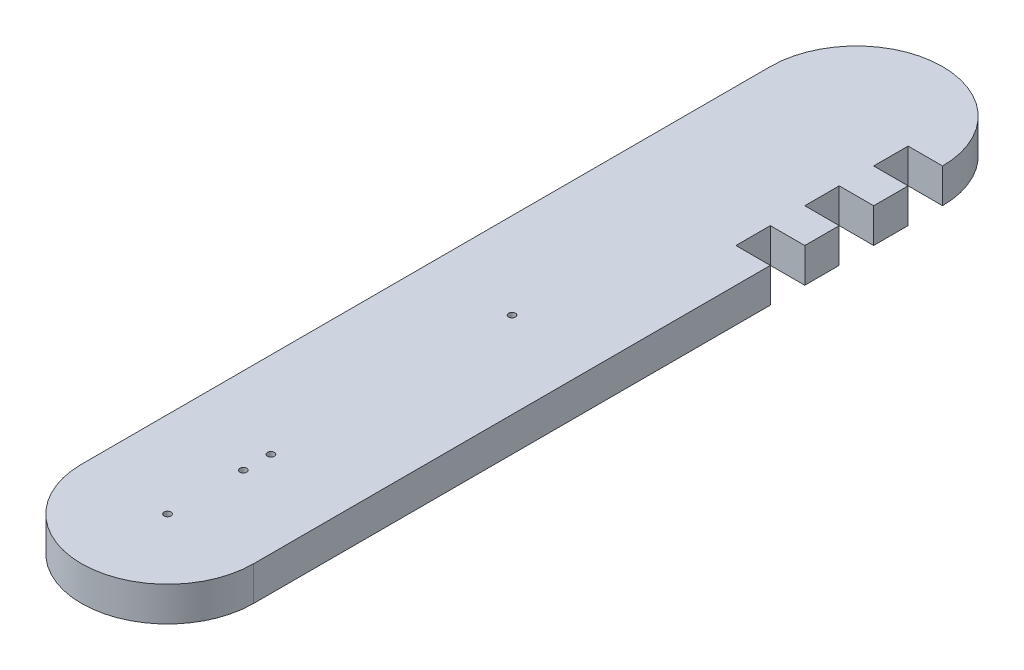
ISO-10303-21;
HEADER;
FILE_DESCRIPTION(('STEP AP214'),'2;1');
FILE_NAME('part.step','',(''),(''),'','','');
FILE_SCHEMA(('AUTOMOTIVE_DESIGN { 1 0 10303 214 1 1 1 1 }'));
ENDSEC;
DATA;
#1=APPLICATION_CONTEXT('core data for automotive mechanical design processes');
#2=APPLICATION_PROTOCOL_DEFINITION('international standard','automotive_design',2000,#1);
#3=PRODUCT_CONTEXT('',#1,'mechanical');
#4=PRODUCT('Part','Part','',(#3));
#5=PRODUCT_RELATED_PRODUCT_CATEGORY('part','',(#4));
#6=PRODUCT_DEFINITION_FORMATION('','',#4);
#7=PRODUCT_DEFINITION_CONTEXT('part definition',#1,'design');
#8=PRODUCT_DEFINITION('design','',#6,#7);
#9=PRODUCT_DEFINITION_SHAPE('','',#8);
#10=(LENGTH_UNIT() NAMED_UNIT(*) SI_UNIT(.MILLI.,.METRE.));
#11=(NAMED_UNIT(*) PLANE_ANGLE_UNIT() SI_UNIT($,.RADIAN.));
#12=(NAMED_UNIT(*) SI_UNIT($,.STERADIAN.) SOLID_ANGLE_UNIT());
#13=UNCERTAINTY_MEASURE_WITH_UNIT(LENGTH_MEASURE(1.E-05),#10,'distance_accuracy_value','');
#14=(GEOMETRIC_REPRESENTATION_CONTEXT(3) GLOBAL_UNCERTAINTY_ASSIGNED_CONTEXT((#13)) GLOBAL_UNIT_ASSIGNED_CONTEXT((#10,
#11,#12)) REPRESENTATION_CONTEXT('',''));
#15=CARTESIAN_POINT('',(0.,0.,0.));
#16=DIRECTION('',(0.,0.,1.));
#17=DIRECTION('',(1.,0.,0.));
#18=AXIS2_PLACEMENT_3D('',#15,#16,#17);
#19=CARTESIAN_POINT('',(25.,5.,100.));
#20=DIRECTION('',(-1.,0.,0.));
#21=DIRECTION('',(0.,0.,1.));
#22=AXIS2_PLACEMENT_3D('',#19,#20,#21);
#23=PLANE('',#22);
#24=DIRECTION('',(0.,0.,-1.));
#25=VECTOR('',#24,1.);
#26=CARTESIAN_POINT('',(25.,0.,100.));
#27=LINE('',#26,#25);
#28=CARTESIAN_POINT('',(25.,0.,20.));
#29=VERTEX_POINT('',#28);
#30=CARTESIAN_POINT('',(25.,0.,15.));
#31=VERTEX_POINT('',#30);
#32=EDGE_CURVE('E270',#29,#31,#27,.T.);
#33=ORIENTED_EDGE('',*,*,#32,.T.);
#34=DIRECTION('',(0.,1.,0.));
#35=VECTOR('',#34,1.);
#36=CARTESIAN_POINT('',(25.,0.,15.));
#37=LINE('',#36,#35);
#38=CARTESIAN_POINT('',(25.,5.,15.));
#39=VERTEX_POINT('',#38);
#40=EDGE_CURVE('E185',#31,#39,#37,.T.);
#41=ORIENTED_EDGE('',*,*,#40,.T.);
#42=DIRECTION('',(0.,0.,-1.));
#43=VECTOR('',#42,1.);
#44=CARTESIAN_POINT('',(25.,5.,100.));
#45=LINE('',#44,#43);
#46=CARTESIAN_POINT('',(25.,5.,20.));
#47=VERTEX_POINT('',#46);
#48=EDGE_CURVE('E261',#47,#39,#45,.T.);
#49=ORIENTED_EDGE('',*,*,#48,.F.);
#50=DIRECTION('',(0.,1.,0.));
#51=VECTOR('',#50,1.);
#52=CARTESIAN_POINT('',(25.,0.,20.));
#53=LINE('',#52,#51);
#54=EDGE_CURVE('E202',#29,#47,#53,.T.);
#55=ORIENTED_EDGE('',*,*,#54,.F.);
#56=EDGE_LOOP('',(#33,#41,#49,#55));
#57=FACE_BOUND('',#56,.T.);
#58=ADVANCED_FACE('F32',(#57),#23,.F.);
#59=CARTESIAN_POINT('',(25.,0.,100.));
#60=VERTEX_POINT('',#59);
#61=CARTESIAN_POINT('',(25.,0.,25.));
#62=VERTEX_POINT('',#61);
#63=EDGE_CURVE('E252',#60,#62,#27,.T.);
#64=ORIENTED_EDGE('',*,*,#63,.T.);
#65=DIRECTION('',(0.,1.,0.));
#66=VECTOR('',#65,1.);
#67=CARTESIAN_POINT('',(25.,0.,25.));
#68=LINE('',#67,#66);
#69=CARTESIAN_POINT('',(25.,5.,25.));
#70=VERTEX_POINT('',#69);
#71=EDGE_CURVE('E209',#62,#70,#68,.T.);
#72=ORIENTED_EDGE('',*,*,#71,.T.);
#73=CARTESIAN_POINT('',(25.,5.,100.));
#74=VERTEX_POINT('',#73);
#75=EDGE_CURVE('E257',#74,#70,#45,.T.);
#76=ORIENTED_EDGE('',*,*,#75,.F.);
#77=DIRECTION('',(0.,-1.,0.));
#78=VECTOR('',#77,1.);
#79=CARTESIAN_POINT('',(25.,5.,100.));
#80=LINE('',#79,#78);
#81=EDGE_CURVE('E272',#74,#60,#80,.T.);
#82=ORIENTED_EDGE('',*,*,#81,.T.);
#83=EDGE_LOOP('',(#64,#72,#76,#82));
#84=FACE_BOUND('',#83,.T.);
#85=ADVANCED_FACE('F285',(#84),#23,.F.);
#86=CARTESIAN_POINT('',(12.5,5.,0.));
#87=DIRECTION('',(0.,1.,0.));
#88=DIRECTION('',(0.,0.,1.));
#89=AXIS2_PLACEMENT_3D('',#86,#87,#88);
#90=PLANE('',#89);
#91=DIRECTION('',(1.,0.,0.));
#92=VECTOR('',#91,1.);
#93=CARTESIAN_POINT('',(20.,5.,5.));
#94=LINE('',#93,#92);
#95=CARTESIAN_POINT('',(20.,5.,5.));
#96=VERTEX_POINT('',#95);
#97=CARTESIAN_POINT('',(25.,5.,5.));
#98=VERTEX_POINT('',#97);
#99=EDGE_CURVE('E164',#96,#98,#94,.T.);
#100=ORIENTED_EDGE('',*,*,#99,.F.);
#101=DIRECTION('',(0.,0.,1.));
#102=VECTOR('',#101,1.);
#103=CARTESIAN_POINT('',(20.,5.,0.));
#104=LINE('',#103,#102);
#105=CARTESIAN_POINT('',(20.,5.,0.));
#106=VERTEX_POINT('',#105);
#107=EDGE_CURVE('E166',#106,#96,#104,.T.);
#108=ORIENTED_EDGE('',*,*,#107,.F.);
#109=DIRECTION('',(-1.,0.,0.));
#110=VECTOR('',#109,1.);
#111=CARTESIAN_POINT('',(25.,5.,0.));
#112=LINE('',#111,#110);
#113=CARTESIAN_POINT('',(25.,5.,0.));
#114=VERTEX_POINT('',#113);
#115=EDGE_CURVE('E145',#114,#106,#112,.T.);
#116=ORIENTED_EDGE('',*,*,#115,.F.);
#117=CARTESIAN_POINT('',(12.5,5.,0.));
#118=DIRECTION('',(0.,1.,0.));
#119=DIRECTION('',(0.,0.,1.));
#120=AXIS2_PLACEMENT_3D('',#117,#118,#119);
#121=CIRCLE('',#120,12.5);
#122=CARTESIAN_POINT('',(0.,5.,0.));
#123=VERTEX_POINT('',#122);
#124=EDGE_CURVE('E248',#114,#123,#121,.T.);
#125=ORIENTED_EDGE('',*,*,#124,.T.);
#126=DIRECTION('',(0.,0.,1.));
#127=VECTOR('',#126,1.);
#128=CARTESIAN_POINT('',(0.,5.,0.));
#129=LINE('',#128,#127);
#130=CARTESIAN_POINT('',(0.,5.,100.));
#131=VERTEX_POINT('',#130);
#132=EDGE_CURVE('E251',#123,#131,#129,.T.);
#133=ORIENTED_EDGE('',*,*,#132,.T.);
#134=CARTESIAN_POINT('',(12.5,5.,100.));
#135=DIRECTION('',(0.,1.,0.));
#136=DIRECTION('',(0.,0.,1.));
#137=AXIS2_PLACEMENT_3D('',#134,#135,#136);
#138=CIRCLE('',#137,12.5);
#139=EDGE_CURVE('E254',#131,#74,#138,.T.);
#140=ORIENTED_EDGE('',*,*,#139,.T.);
#141=ORIENTED_EDGE('',*,*,#75,.T.);
#142=DIRECTION('',(1.,0.,0.));
#143=VECTOR('',#142,1.);
#144=CARTESIAN_POINT('',(20.,5.,25.));
#145=LINE('',#144,#143);
#146=CARTESIAN_POINT('',(20.,5.,25.));
#147=VERTEX_POINT('',#146);
#148=EDGE_CURVE('E212',#147,#70,#145,.T.);
#149=ORIENTED_EDGE('',*,*,#148,.F.);
#150=DIRECTION('',(0.,0.,1.));
#151=VECTOR('',#150,1.);
#152=CARTESIAN_POINT('',(20.,5.,20.));
#153=LINE('',#152,#151);
#154=CARTESIAN_POINT('',(20.,5.,20.));
#155=VERTEX_POINT('',#154);
#156=EDGE_CURVE('E214',#155,#147,#153,.T.);
#157=ORIENTED_EDGE('',*,*,#156,.F.);
#158=DIRECTION('',(-1.,0.,0.));
#159=VECTOR('',#158,1.);
#160=CARTESIAN_POINT('',(25.,5.,20.));
#161=LINE('',#160,#159);
#162=EDGE_CURVE('E188',#47,#155,#161,.T.);
#163=ORIENTED_EDGE('',*,*,#162,.F.);
#164=ORIENTED_EDGE('',*,*,#48,.T.);
#165=DIRECTION('',(1.,0.,0.));
#166=VECTOR('',#165,1.);
#167=CARTESIAN_POINT('',(20.,5.,15.));
#168=LINE('',#167,#166);
#169=CARTESIAN_POINT('',(20.,5.,15.));
#170=VERTEX_POINT('',#169);
#171=EDGE_CURVE('E189',#170,#39,#168,.T.);
#172=ORIENTED_EDGE('',*,*,#171,.F.);
#173=DIRECTION('',(0.,0.,1.));
#174=VECTOR('',#173,1.);
#175=CARTESIAN_POINT('',(20.,5.,10.));
#176=LINE('',#175,#174);
#177=CARTESIAN_POINT('',(20.,5.,10.));
#178=VERTEX_POINT('',#177);
#179=EDGE_CURVE('E191',#178,#170,#176,.T.);
#180=ORIENTED_EDGE('',*,*,#179,.F.);
#181=DIRECTION('',(-1.,0.,0.));
#182=VECTOR('',#181,1.);
#183=CARTESIAN_POINT('',(25.,5.,10.));
#184=LINE('',#183,#182);
#185=CARTESIAN_POINT('',(25.,5.,10.));
#186=VERTEX_POINT('',#185);
#187=EDGE_CURVE('E171',#186,#178,#184,.T.);
#188=ORIENTED_EDGE('',*,*,#187,.F.);
#189=EDGE_CURVE('E256',#186,#98,#45,.T.);
#190=ORIENTED_EDGE('',*,*,#189,.T.);
#191=EDGE_LOOP('',(#100,#108,#116,#125,#133,#140,#141,#149,#157,#163,#164,#172,#180,#188,#190));
#192=FACE_BOUND('',#191,.T.);
#193=CARTESIAN_POINT('',(12.5,5.,85.));
#194=DIRECTION('',(0.,1.,0.));
#195=DIRECTION('',(0.,0.,1.));
#196=AXIS2_PLACEMENT_3D('',#193,#194,#195);
#197=CIRCLE('',#196,0.500000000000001);
#198=CARTESIAN_POINT('',(12.5,5.,85.5));
#199=VERTEX_POINT('',#198);
#200=EDGE_CURVE('E231',#199,#199,#197,.T.);
#201=ORIENTED_EDGE('',*,*,#200,.F.);
#202=EDGE_LOOP('',(#201));
#203=FACE_BOUND('',#202,.T.);
#204=CARTESIAN_POINT('',(12.5,5.,100.));
#205=DIRECTION('',(0.,1.,0.));
#206=DIRECTION('',(0.,0.,1.));
#207=AXIS2_PLACEMENT_3D('',#204,#205,#206);
#208=CIRCLE('',#207,0.500000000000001);
#209=CARTESIAN_POINT('',(12.5,5.,100.5));
#210=VERTEX_POINT('',#209);
#211=EDGE_CURVE('E243',#210,#210,#208,.T.);
#212=ORIENTED_EDGE('',*,*,#211,.F.);
#213=EDGE_LOOP('',(#212));
#214=FACE_BOUND('',#213,.T.);
#215=CARTESIAN_POINT('',(12.5,5.,89.));
#216=DIRECTION('',(0.,1.,0.));
#217=DIRECTION('',(0.,0.,1.));
#218=AXIS2_PLACEMENT_3D('',#215,#216,#217);
#219=CIRCLE('',#218,0.500000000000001);
#220=CARTESIAN_POINT('',(12.5,5.,89.5));
#221=VERTEX_POINT('',#220);
#222=EDGE_CURVE('E237',#221,#221,#219,.T.);
#223=ORIENTED_EDGE('',*,*,#222,.F.);
#224=EDGE_LOOP('',(#223));
#225=FACE_BOUND('',#224,.T.);
#226=CARTESIAN_POINT('',(12.5,5.,50.));
#227=DIRECTION('',(0.,1.,0.));
#228=DIRECTION('',(0.,0.,1.));
#229=AXIS2_PLACEMENT_3D('',#226,#227,#228);
#230=CIRCLE('',#229,0.500000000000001);
#231=CARTESIAN_POINT('',(12.5,5.,50.5));
#232=VERTEX_POINT('',#231);
#233=EDGE_CURVE('E225',#232,#232,#230,.T.);
#234=ORIENTED_EDGE('',*,*,#233,.F.);
#235=EDGE_LOOP('',(#234));
#236=FACE_BOUND('',#235,.T.);
#237=ADVANCED_FACE('F290',(#192,#203,#214,#225,#236),#90,.T.);
#238=CARTESIAN_POINT('',(12.5,0.,0.));
#239=DIRECTION('',(0.,1.,0.));
#240=DIRECTION('',(0.,0.,1.));
#241=AXIS2_PLACEMENT_3D('',#238,#239,#240);
#242=PLANE('',#241);
#243=DIRECTION('',(0.,0.,1.));
#244=VECTOR('',#243,1.);
#245=CARTESIAN_POINT('',(20.,0.,0.));
#246=LINE('',#245,#244);
#247=CARTESIAN_POINT('',(20.,0.,0.));
#248=VERTEX_POINT('',#247);
#249=CARTESIAN_POINT('',(20.,0.,5.));
#250=VERTEX_POINT('',#249);
#251=EDGE_CURVE('E153',#248,#250,#246,.T.);
#252=ORIENTED_EDGE('',*,*,#251,.T.);
#253=DIRECTION('',(1.,0.,0.));
#254=VECTOR('',#253,1.);
#255=CARTESIAN_POINT('',(20.,0.,5.));
#256=LINE('',#255,#254);
#257=CARTESIAN_POINT('',(25.,0.,5.));
#258=VERTEX_POINT('',#257);
#259=EDGE_CURVE('E150',#250,#258,#256,.T.);
#260=ORIENTED_EDGE('',*,*,#259,.T.);
#261=CARTESIAN_POINT('',(25.,0.,10.));
#262=VERTEX_POINT('',#261);
#263=EDGE_CURVE('E267',#262,#258,#27,.T.);
#264=ORIENTED_EDGE('',*,*,#263,.F.);
#265=DIRECTION('',(-1.,0.,0.));
#266=VECTOR('',#265,1.);
#267=CARTESIAN_POINT('',(25.,0.,10.));
#268=LINE('',#267,#266);
#269=CARTESIAN_POINT('',(20.,0.,10.));
#270=VERTEX_POINT('',#269);
#271=EDGE_CURVE('E47',#262,#270,#268,.T.);
#272=ORIENTED_EDGE('',*,*,#271,.T.);
#273=DIRECTION('',(0.,0.,1.));
#274=VECTOR('',#273,1.);
#275=CARTESIAN_POINT('',(20.,0.,10.));
#276=LINE('',#275,#274);
#277=CARTESIAN_POINT('',(20.,0.,15.));
#278=VERTEX_POINT('',#277);
#279=EDGE_CURVE('E198',#270,#278,#276,.T.);
#280=ORIENTED_EDGE('',*,*,#279,.T.);
#281=DIRECTION('',(1.,0.,0.));
#282=VECTOR('',#281,1.);
#283=CARTESIAN_POINT('',(20.,0.,15.));
#284=LINE('',#283,#282);
#285=EDGE_CURVE('E180',#278,#31,#284,.T.);
#286=ORIENTED_EDGE('',*,*,#285,.T.);
#287=ORIENTED_EDGE('',*,*,#32,.F.);
#288=DIRECTION('',(-1.,0.,0.));
#289=VECTOR('',#288,1.);
#290=CARTESIAN_POINT('',(25.,0.,20.));
#291=LINE('',#290,#289);
#292=CARTESIAN_POINT('',(20.,0.,20.));
#293=VERTEX_POINT('',#292);
#294=EDGE_CURVE('E55',#29,#293,#291,.T.);
#295=ORIENTED_EDGE('',*,*,#294,.T.);
#296=DIRECTION('',(0.,0.,1.));
#297=VECTOR('',#296,1.);
#298=CARTESIAN_POINT('',(20.,0.,20.));
#299=LINE('',#298,#297);
#300=CARTESIAN_POINT('',(20.,0.,25.));
#301=VERTEX_POINT('',#300);
#302=EDGE_CURVE('E221',#293,#301,#299,.T.);
#303=ORIENTED_EDGE('',*,*,#302,.T.);
#304=DIRECTION('',(1.,0.,0.));
#305=VECTOR('',#304,1.);
#306=CARTESIAN_POINT('',(20.,0.,25.));
#307=LINE('',#306,#305);
#308=EDGE_CURVE('E204',#301,#62,#307,.T.);
#309=ORIENTED_EDGE('',*,*,#308,.T.);
#310=ORIENTED_EDGE('',*,*,#63,.F.);
#311=CARTESIAN_POINT('',(12.5,0.,100.));
#312=DIRECTION('',(0.,1.,0.));
#313=DIRECTION('',(0.,0.,1.));
#314=AXIS2_PLACEMENT_3D('',#311,#312,#313);
#315=CIRCLE('',#314,12.5);
#316=CARTESIAN_POINT('',(0.,0.,100.));
#317=VERTEX_POINT('',#316);
#318=EDGE_CURVE('E265',#317,#60,#315,.T.);
#319=ORIENTED_EDGE('',*,*,#318,.F.);
#320=DIRECTION('',(0.,0.,1.));
#321=VECTOR('',#320,1.);
#322=CARTESIAN_POINT('',(0.,0.,0.));
#323=LINE('',#322,#321);
#324=CARTESIAN_POINT('',(0.,0.,0.));
#325=VERTEX_POINT('',#324);
#326=EDGE_CURVE('E263',#325,#317,#323,.T.);
#327=ORIENTED_EDGE('',*,*,#326,.F.);
#328=CARTESIAN_POINT('',(12.5,0.,0.));
#329=DIRECTION('',(0.,1.,0.));
#330=DIRECTION('',(0.,0.,1.));
#331=AXIS2_PLACEMENT_3D('',#328,#329,#330);
#332=CIRCLE('',#331,12.5);
#333=CARTESIAN_POINT('',(25.,0.,0.));
#334=VERTEX_POINT('',#333);
#335=EDGE_CURVE('E163',#334,#325,#332,.T.);
#336=ORIENTED_EDGE('',*,*,#335,.F.);
#337=DIRECTION('',(-1.,0.,0.));
#338=VECTOR('',#337,1.);
#339=CARTESIAN_POINT('',(25.,0.,0.));
#340=LINE('',#339,#338);
#341=EDGE_CURVE('E142',#334,#248,#340,.T.);
#342=ORIENTED_EDGE('',*,*,#341,.T.);
#343=EDGE_LOOP('',(#252,#260,#264,#272,#280,#286,#287,#295,#303,#309,#310,#319,#327,#336,#342));
#344=FACE_BOUND('',#343,.T.);
#345=CARTESIAN_POINT('',(12.5,0.,100.));
#346=DIRECTION('',(0.,1.,0.));
#347=DIRECTION('',(0.,0.,1.));
#348=AXIS2_PLACEMENT_3D('',#345,#346,#347);
#349=CIRCLE('',#348,0.500000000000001);
#350=CARTESIAN_POINT('',(12.5,0.,100.5));
#351=VERTEX_POINT('',#350);
#352=EDGE_CURVE('E240',#351,#351,#349,.T.);
#353=ORIENTED_EDGE('',*,*,#352,.T.);
#354=EDGE_LOOP('',(#353));
#355=FACE_BOUND('',#354,.T.);
#356=CARTESIAN_POINT('',(12.5,0.,89.));
#357=DIRECTION('',(0.,1.,0.));
#358=DIRECTION('',(0.,0.,1.));
#359=AXIS2_PLACEMENT_3D('',#356,#357,#358);
#360=CIRCLE('',#359,0.500000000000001);
#361=CARTESIAN_POINT('',(12.5,0.,89.5));
#362=VERTEX_POINT('',#361);
#363=EDGE_CURVE('E234',#362,#362,#360,.T.);
#364=ORIENTED_EDGE('',*,*,#363,.T.);
#365=EDGE_LOOP('',(#364));
#366=FACE_BOUND('',#365,.T.);
#367=CARTESIAN_POINT('',(12.5,0.,85.));
#368=DIRECTION('',(0.,1.,0.));
#369=DIRECTION('',(0.,0.,1.));
#370=AXIS2_PLACEMENT_3D('',#367,#368,#369);
#371=CIRCLE('',#370,0.500000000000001);
#372=CARTESIAN_POINT('',(12.5,0.,85.5));
#373=VERTEX_POINT('',#372);
#374=EDGE_CURVE('E228',#373,#373,#371,.T.);
#375=ORIENTED_EDGE('',*,*,#374,.T.);
#376=EDGE_LOOP('',(#375));
#377=FACE_BOUND('',#376,.T.);
#378=CARTESIAN_POINT('',(12.5,0.,50.));
#379=DIRECTION('',(0.,1.,0.));
#380=DIRECTION('',(0.,0.,1.));
#381=AXIS2_PLACEMENT_3D('',#378,#379,#380);
#382=CIRCLE('',#381,0.500000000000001);
#383=CARTESIAN_POINT('',(12.5,0.,50.5));
#384=VERTEX_POINT('',#383);
#385=EDGE_CURVE('E176',#384,#384,#382,.T.);
#386=ORIENTED_EDGE('',*,*,#385,.T.);
#387=EDGE_LOOP('',(#386));
#388=FACE_BOUND('',#387,.T.);
#389=ADVANCED_FACE('F160',(#344,#355,#366,#377,#388),#242,.F.);
#390=CARTESIAN_POINT('',(12.5,5.,0.));
#391=DIRECTION('',(0.,-1.,0.));
#392=DIRECTION('',(0.,0.,-1.));
#393=AXIS2_PLACEMENT_3D('',#390,#391,#392);
#394=CYLINDRICAL_SURFACE('',#393,12.5);
#395=ORIENTED_EDGE('',*,*,#335,.T.);
#396=DIRECTION('',(0.,-1.,0.));
#397=VECTOR('',#396,1.);
#398=CARTESIAN_POINT('',(0.,5.,0.));
#399=LINE('',#398,#397);
#400=EDGE_CURVE('E11',#123,#325,#399,.T.);
#401=ORIENTED_EDGE('',*,*,#400,.F.);
#402=ORIENTED_EDGE('',*,*,#124,.F.);
#403=DIRECTION('',(0.,-1.,0.));
#404=VECTOR('',#403,1.);
#405=CARTESIAN_POINT('',(25.,5.,0.));
#406=LINE('',#405,#404);
#407=EDGE_CURVE('E260',#114,#334,#406,.T.);
#408=ORIENTED_EDGE('',*,*,#407,.T.);
#409=EDGE_LOOP('',(#395,#401,#402,#408));
#410=FACE_BOUND('',#409,.T.);
#411=ADVANCED_FACE('F34',(#410),#394,.T.);
#412=CARTESIAN_POINT('',(0.,5.,0.));
#413=DIRECTION('',(1.,0.,0.));
#414=DIRECTION('',(0.,0.,-1.));
#415=AXIS2_PLACEMENT_3D('',#412,#413,#414);
#416=PLANE('',#415);
#417=ORIENTED_EDGE('',*,*,#326,.T.);
#418=DIRECTION('',(0.,-1.,0.));
#419=VECTOR('',#418,1.);
#420=CARTESIAN_POINT('',(0.,5.,100.));
#421=LINE('',#420,#419);
#422=EDGE_CURVE('E40',#131,#317,#421,.T.);
#423=ORIENTED_EDGE('',*,*,#422,.F.);
#424=ORIENTED_EDGE('',*,*,#132,.F.);
#425=ORIENTED_EDGE('',*,*,#400,.T.);
#426=EDGE_LOOP('',(#417,#423,#424,#425));
#427=FACE_BOUND('',#426,.T.);
#428=ADVANCED_FACE('F295',(#427),#416,.F.);
#429=CARTESIAN_POINT('',(12.5,5.,100.));
#430=DIRECTION('',(0.,-1.,0.));
#431=DIRECTION('',(0.,0.,-1.));
#432=AXIS2_PLACEMENT_3D('',#429,#430,#431);
#433=CYLINDRICAL_SURFACE('',#432,12.5);
#434=ORIENTED_EDGE('',*,*,#318,.T.);
#435=ORIENTED_EDGE('',*,*,#81,.F.);
#436=ORIENTED_EDGE('',*,*,#139,.F.);
#437=ORIENTED_EDGE('',*,*,#422,.T.);
#438=EDGE_LOOP('',(#434,#435,#436,#437));
#439=FACE_BOUND('',#438,.T.);
#440=ADVANCED_FACE('F279',(#439),#433,.T.);
#441=ORIENTED_EDGE('',*,*,#263,.T.);
#442=DIRECTION('',(0.,1.,0.));
#443=VECTOR('',#442,1.);
#444=CARTESIAN_POINT('',(25.,0.,5.));
#445=LINE('',#444,#443);
#446=EDGE_CURVE('E173',#258,#98,#445,.T.);
#447=ORIENTED_EDGE('',*,*,#446,.T.);
#448=ORIENTED_EDGE('',*,*,#189,.F.);
#449=DIRECTION('',(0.,1.,0.));
#450=VECTOR('',#449,1.);
#451=CARTESIAN_POINT('',(25.,0.,10.));
#452=LINE('',#451,#450);
#453=EDGE_CURVE('E178',#262,#186,#452,.T.);
#454=ORIENTED_EDGE('',*,*,#453,.F.);
#455=EDGE_LOOP('',(#441,#447,#448,#454));
#456=FACE_BOUND('',#455,.T.);
#457=ADVANCED_FACE('F304',(#456),#23,.F.);
#458=CARTESIAN_POINT('',(12.5,5.,100.));
#459=DIRECTION('',(0.,-1.,0.));
#460=DIRECTION('',(0.,0.,-1.));
#461=AXIS2_PLACEMENT_3D('',#458,#459,#460);
#462=CYLINDRICAL_SURFACE('',#461,0.500000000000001);
#463=ORIENTED_EDGE('',*,*,#211,.T.);
#464=EDGE_LOOP('',(#463));
#465=FACE_BOUND('',#464,.T.);
#466=ORIENTED_EDGE('',*,*,#352,.F.);
#467=EDGE_LOOP('',(#466));
#468=FACE_BOUND('',#467,.T.);
#469=ADVANCED_FACE('F343',(#465,#468),#462,.F.);
#470=CARTESIAN_POINT('',(12.5,5.,89.));
#471=DIRECTION('',(0.,-1.,0.));
#472=DIRECTION('',(0.,0.,-1.));
#473=AXIS2_PLACEMENT_3D('',#470,#471,#472);
#474=CYLINDRICAL_SURFACE('',#473,0.500000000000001);
#475=ORIENTED_EDGE('',*,*,#222,.T.);
#476=EDGE_LOOP('',(#475));
#477=FACE_BOUND('',#476,.T.);
#478=ORIENTED_EDGE('',*,*,#363,.F.);
#479=EDGE_LOOP('',(#478));
#480=FACE_BOUND('',#479,.T.);
#481=ADVANCED_FACE('F348',(#477,#480),#474,.F.);
#482=CARTESIAN_POINT('',(12.5,5.,85.));
#483=DIRECTION('',(0.,-1.,0.));
#484=DIRECTION('',(0.,0.,-1.));
#485=AXIS2_PLACEMENT_3D('',#482,#483,#484);
#486=CYLINDRICAL_SURFACE('',#485,0.500000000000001);
#487=ORIENTED_EDGE('',*,*,#200,.T.);
#488=EDGE_LOOP('',(#487));
#489=FACE_BOUND('',#488,.T.);
#490=ORIENTED_EDGE('',*,*,#374,.F.);
#491=EDGE_LOOP('',(#490));
#492=FACE_BOUND('',#491,.T.);
#493=ADVANCED_FACE('F332',(#489,#492),#486,.F.);
#494=CARTESIAN_POINT('',(12.5,5.,50.));
#495=DIRECTION('',(0.,-1.,0.));
#496=DIRECTION('',(0.,0.,-1.));
#497=AXIS2_PLACEMENT_3D('',#494,#495,#496);
#498=CYLINDRICAL_SURFACE('',#497,0.500000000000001);
#499=ORIENTED_EDGE('',*,*,#233,.T.);
#500=EDGE_LOOP('',(#499));
#501=FACE_BOUND('',#500,.T.);
#502=ORIENTED_EDGE('',*,*,#385,.F.);
#503=EDGE_LOOP('',(#502));
#504=FACE_BOUND('',#503,.T.);
#505=ADVANCED_FACE('F325',(#501,#504),#498,.F.);
#506=CARTESIAN_POINT('',(20.,0.,25.));
#507=DIRECTION('',(0.,0.,1.));
#508=DIRECTION('',(1.,0.,0.));
#509=AXIS2_PLACEMENT_3D('',#506,#507,#508);
#510=PLANE('',#509);
#511=ORIENTED_EDGE('',*,*,#148,.T.);
#512=ORIENTED_EDGE('',*,*,#71,.F.);
#513=ORIENTED_EDGE('',*,*,#308,.F.);
#514=DIRECTION('',(0.,1.,0.));
#515=VECTOR('',#514,1.);
#516=CARTESIAN_POINT('',(20.,0.,25.));
#517=LINE('',#516,#515);
#518=EDGE_CURVE('E207',#301,#147,#517,.T.);
#519=ORIENTED_EDGE('',*,*,#518,.T.);
#520=EDGE_LOOP('',(#511,#512,#513,#519));
#521=FACE_BOUND('',#520,.T.);
#522=ADVANCED_FACE('F323',(#521),#510,.F.);
#523=CARTESIAN_POINT('',(20.,0.,20.));
#524=DIRECTION('',(-1.,0.,0.));
#525=DIRECTION('',(0.,0.,1.));
#526=AXIS2_PLACEMENT_3D('',#523,#524,#525);
#527=PLANE('',#526);
#528=ORIENTED_EDGE('',*,*,#156,.T.);
#529=ORIENTED_EDGE('',*,*,#518,.F.);
#530=ORIENTED_EDGE('',*,*,#302,.F.);
#531=DIRECTION('',(0.,1.,0.));
#532=VECTOR('',#531,1.);
#533=CARTESIAN_POINT('',(20.,0.,20.));
#534=LINE('',#533,#532);
#535=EDGE_CURVE('E205',#293,#155,#534,.T.);
#536=ORIENTED_EDGE('',*,*,#535,.T.);
#537=EDGE_LOOP('',(#528,#529,#530,#536));
#538=FACE_BOUND('',#537,.T.);
#539=ADVANCED_FACE('F321',(#538),#527,.F.);
#540=CARTESIAN_POINT('',(25.,0.,20.));
#541=DIRECTION('',(0.,0.,-1.));
#542=DIRECTION('',(-1.,0.,0.));
#543=AXIS2_PLACEMENT_3D('',#540,#541,#542);
#544=PLANE('',#543);
#545=ORIENTED_EDGE('',*,*,#162,.T.);
#546=ORIENTED_EDGE('',*,*,#535,.F.);
#547=ORIENTED_EDGE('',*,*,#294,.F.);
#548=ORIENTED_EDGE('',*,*,#54,.T.);
#549=EDGE_LOOP('',(#545,#546,#547,#548));
#550=FACE_BOUND('',#549,.T.);
#551=ADVANCED_FACE('F318',(#550),#544,.F.);
#552=CARTESIAN_POINT('',(20.,0.,15.));
#553=DIRECTION('',(0.,0.,1.));
#554=DIRECTION('',(1.,0.,0.));
#555=AXIS2_PLACEMENT_3D('',#552,#553,#554);
#556=PLANE('',#555);
#557=ORIENTED_EDGE('',*,*,#171,.T.);
#558=ORIENTED_EDGE('',*,*,#40,.F.);
#559=ORIENTED_EDGE('',*,*,#285,.F.);
#560=DIRECTION('',(0.,1.,0.));
#561=VECTOR('',#560,1.);
#562=CARTESIAN_POINT('',(20.,0.,15.));
#563=LINE('',#562,#561);
#564=EDGE_CURVE('E183',#278,#170,#563,.T.);
#565=ORIENTED_EDGE('',*,*,#564,.T.);
#566=EDGE_LOOP('',(#557,#558,#559,#565));
#567=FACE_BOUND('',#566,.T.);
#568=ADVANCED_FACE('F314',(#567),#556,.F.);
#569=CARTESIAN_POINT('',(20.,0.,10.));
#570=DIRECTION('',(-1.,0.,0.));
#571=DIRECTION('',(0.,0.,1.));
#572=AXIS2_PLACEMENT_3D('',#569,#570,#571);
#573=PLANE('',#572);
#574=ORIENTED_EDGE('',*,*,#179,.T.);
#575=ORIENTED_EDGE('',*,*,#564,.F.);
#576=ORIENTED_EDGE('',*,*,#279,.F.);
#577=DIRECTION('',(0.,1.,0.));
#578=VECTOR('',#577,1.);
#579=CARTESIAN_POINT('',(20.,0.,10.));
#580=LINE('',#579,#578);
#581=EDGE_CURVE('E181',#270,#178,#580,.T.);
#582=ORIENTED_EDGE('',*,*,#581,.T.);
#583=EDGE_LOOP('',(#574,#575,#576,#582));
#584=FACE_BOUND('',#583,.T.);
#585=ADVANCED_FACE('F454',(#584),#573,.F.);
#586=CARTESIAN_POINT('',(25.,0.,10.));
#587=DIRECTION('',(0.,0.,-1.));
#588=DIRECTION('',(-1.,0.,0.));
#589=AXIS2_PLACEMENT_3D('',#586,#587,#588);
#590=PLANE('',#589);
#591=ORIENTED_EDGE('',*,*,#187,.T.);
#592=ORIENTED_EDGE('',*,*,#581,.F.);
#593=ORIENTED_EDGE('',*,*,#271,.F.);
#594=ORIENTED_EDGE('',*,*,#453,.T.);
#595=EDGE_LOOP('',(#591,#592,#593,#594));
#596=FACE_BOUND('',#595,.T.);
#597=ADVANCED_FACE('F463',(#596),#590,.F.);
#598=CARTESIAN_POINT('',(20.,0.,5.));
#599=DIRECTION('',(0.,0.,1.));
#600=DIRECTION('',(1.,0.,0.));
#601=AXIS2_PLACEMENT_3D('',#598,#599,#600);
#602=PLANE('',#601);
#603=ORIENTED_EDGE('',*,*,#99,.T.);
#604=ORIENTED_EDGE('',*,*,#446,.F.);
#605=ORIENTED_EDGE('',*,*,#259,.F.);
#606=DIRECTION('',(0.,1.,0.));
#607=VECTOR('',#606,1.);
#608=CARTESIAN_POINT('',(20.,0.,5.));
#609=LINE('',#608,#607);
#610=EDGE_CURVE('E149',#250,#96,#609,.T.);
#611=ORIENTED_EDGE('',*,*,#610,.T.);
#612=EDGE_LOOP('',(#603,#604,#605,#611));
#613=FACE_BOUND('',#612,.T.);
#614=ADVANCED_FACE('F301',(#613),#602,.F.);
#615=CARTESIAN_POINT('',(20.,0.,0.));
#616=DIRECTION('',(-1.,0.,0.));
#617=DIRECTION('',(0.,0.,1.));
#618=AXIS2_PLACEMENT_3D('',#615,#616,#617);
#619=PLANE('',#618);
#620=ORIENTED_EDGE('',*,*,#107,.T.);
#621=ORIENTED_EDGE('',*,*,#610,.F.);
#622=ORIENTED_EDGE('',*,*,#251,.F.);
#623=DIRECTION('',(0.,1.,0.));
#624=VECTOR('',#623,1.);
#625=CARTESIAN_POINT('',(20.,0.,0.));
#626=LINE('',#625,#624);
#627=EDGE_CURVE('E138',#248,#106,#626,.T.);
#628=ORIENTED_EDGE('',*,*,#627,.T.);
#629=EDGE_LOOP('',(#620,#621,#622,#628));
#630=FACE_BOUND('',#629,.T.);
#631=ADVANCED_FACE('F154',(#630),#619,.F.);
#632=CARTESIAN_POINT('',(25.,0.,0.));
#633=DIRECTION('',(0.,0.,-1.));
#634=DIRECTION('',(-1.,0.,0.));
#635=AXIS2_PLACEMENT_3D('',#632,#633,#634);
#636=PLANE('',#635);
#637=ORIENTED_EDGE('',*,*,#115,.T.);
#638=ORIENTED_EDGE('',*,*,#627,.F.);
#639=ORIENTED_EDGE('',*,*,#341,.F.);
#640=ORIENTED_EDGE('',*,*,#407,.F.);
#641=EDGE_LOOP('',(#637,#638,#639,#640));
#642=FACE_BOUND('',#641,.T.);
#643=ADVANCED_FACE('F140',(#642),#636,.F.);
#644=CLOSED_SHELL('',(#58,#85,#237,#389,#411,#428,#440,#457,#469,#481,#493,#505,#522,#539,#551,
#568,#585,#597,#614,#631,#643));
#645=MANIFOLD_SOLID_BREP('B2',#644);
#646=ADVANCED_BREP_SHAPE_REPRESENTATION('',(#18,#645),#14);
#647=SHAPE_DEFINITION_REPRESENTATION(#9,#646);
ENDSEC;
END-ISO-10303-21;
